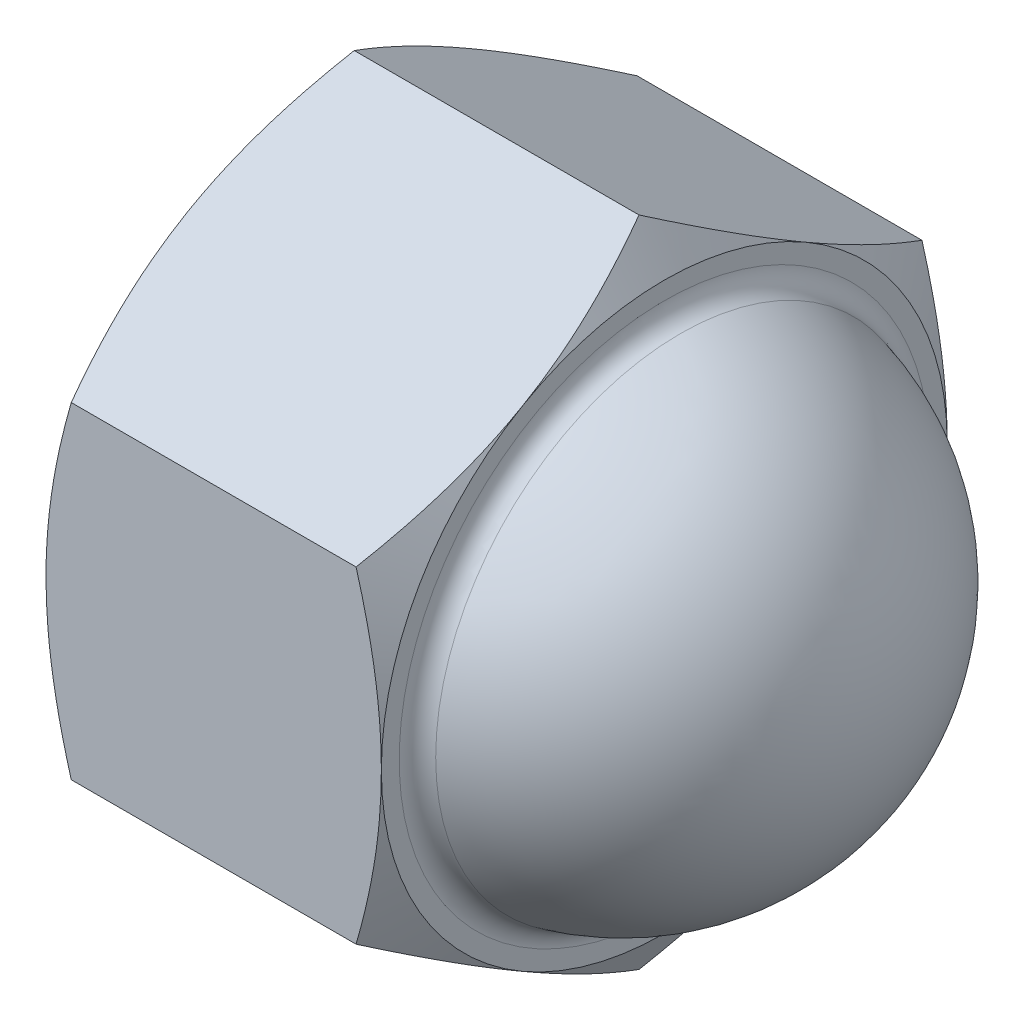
from build123d import *

# Parameters (mm, degrees)
BASENUT_DEPTH = 16
DOMEFILLET_R  = 1


with BuildPart() as part:
    # BaseNutSke → BaseNut (new body)
    with BuildSketch(Plane(origin=(0, 0, 0), x_dir=(0, 0, -1), z_dir=(1, 0, 0))):
        Polygon((13.5, 7.794228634), (13.5, -7.794228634), (0, -15.588457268), (-13.5, -7.794228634), (-13.5, 7.794228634), (0, 15.588457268), align=None)
    extrude(amount=BASENUT_DEPTH)

    # DomeSke → Dome (revolve)
    with BuildSketch(Plane.XY, mode=Mode.PRIVATE) as dome_sk:
        with BuildLine():
            Line((26, 0), (24.4, 0))
            ThreePointArc((24.4, 0), (21.353910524, 7.353910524), (14, 10.4))
            Line((14, 10.4), (0, 10.4))
            Line((0, 10.4), (0, 12))
            Line((0, 12), (14, 12))
            ThreePointArc((14, 12), (22.485281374, 8.485281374), (26, 0))
        make_face()
    revolve(dome_sk.sketch.rotate(Axis((0, 0, 0), (1, 0, 0)), 180), axis=Axis((0, 0, 0), (1, 0, 0)))

    # Sketch4 → DoubleChamfer (revolve, cut)
    with BuildSketch(Plane.XY):
        Polygon((0, 13.5), (2.504809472, 17.838457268), (13.495190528, 17.838457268), (16, 13.5), (18, 13.5), (18, 28.5), (-2, 28.5), (-2, 13.5), align=None)
    revolve(axis=Axis((0, 0, 0), (1, 0, 0)), mode=Mode.SUBTRACT)

    # TapDriSke → TapDrill (revolve, cut)
    with BuildSketch(Plane.XY):
        Polygon((0, 8.75), (18.4, 8.75), (23.657530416, 0), (0, 0), align=None)
    revolve(axis=Axis((0, 0, 0), (1, 0, 0)), mode=Mode.SUBTRACT)

    # EndChamferSketch → EndChamfer (revolve, cut)
    with BuildSketch(Plane.XY, mode=Mode.PRIVATE) as endchamfer_sk:
        Polygon((-0.0746, 10), (0.0254, 10), (0.988185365, 8.625), (-0.0746, 8.625), align=None)
        Polygon((15.9746, 10), (16.1, 10), (16.1, 8.625), (15.011814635, 8.625), align=None)
    revolve(endchamfer_sk.sketch.rotate(Axis((0, 0, 0), (-1, 0, 0)), 90), axis=Axis((0, 0, 0), (-1, 0, 0)), mode=Mode.SUBTRACT)

    # DomeFillet
    domefillet_edges = [part.edges().sort_by_distance(p)[0] for p in [
        (16, 11.832159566, 0),
    ]]
    fillet(domefillet_edges, radius=DOMEFILLET_R)


solid = part.part
